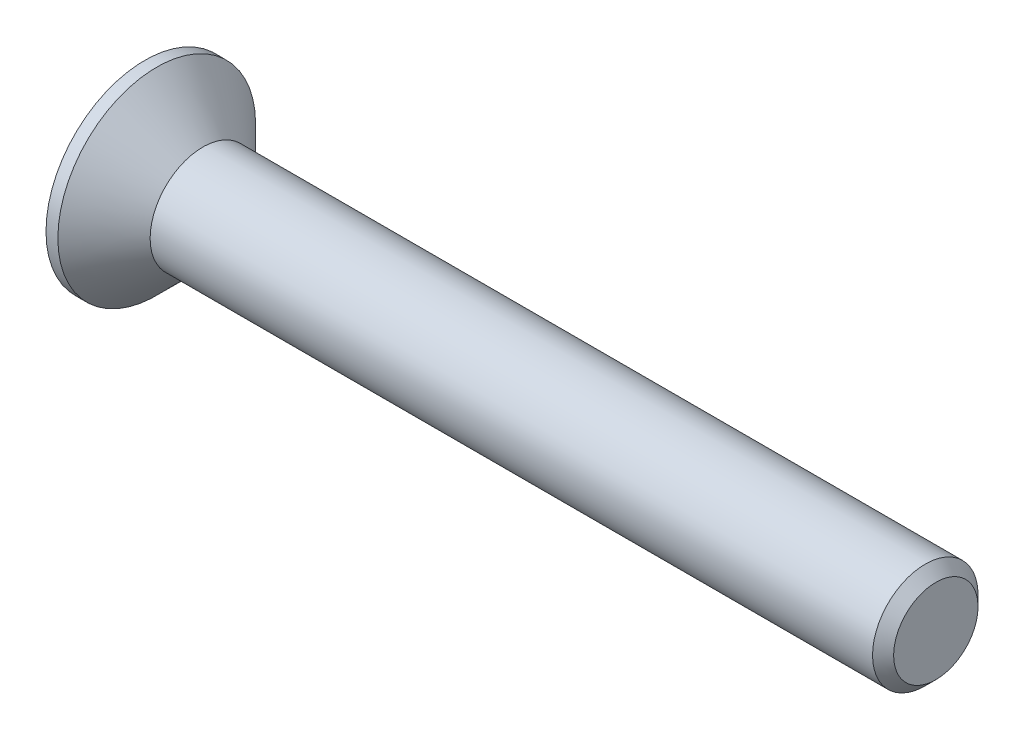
ISO-10303-21;
HEADER;
FILE_DESCRIPTION(('STEP AP214'),'2;1');
FILE_NAME('part.step','',(''),(''),'','','');
FILE_SCHEMA(('AUTOMOTIVE_DESIGN { 1 0 10303 214 1 1 1 1 }'));
ENDSEC;
DATA;
#1=APPLICATION_CONTEXT('core data for automotive mechanical design processes');
#2=APPLICATION_PROTOCOL_DEFINITION('international standard','automotive_design',2000,#1);
#3=PRODUCT_CONTEXT('',#1,'mechanical');
#4=PRODUCT('Part','Part','',(#3));
#5=PRODUCT_RELATED_PRODUCT_CATEGORY('part','',(#4));
#6=PRODUCT_DEFINITION_FORMATION('','',#4);
#7=PRODUCT_DEFINITION_CONTEXT('part definition',#1,'design');
#8=PRODUCT_DEFINITION('design','',#6,#7);
#9=PRODUCT_DEFINITION_SHAPE('','',#8);
#10=(LENGTH_UNIT() NAMED_UNIT(*) SI_UNIT(.MILLI.,.METRE.));
#11=(NAMED_UNIT(*) PLANE_ANGLE_UNIT() SI_UNIT($,.RADIAN.));
#12=(NAMED_UNIT(*) SI_UNIT($,.STERADIAN.) SOLID_ANGLE_UNIT());
#13=UNCERTAINTY_MEASURE_WITH_UNIT(LENGTH_MEASURE(1.E-05),#10,'distance_accuracy_value','');
#14=(GEOMETRIC_REPRESENTATION_CONTEXT(3) GLOBAL_UNCERTAINTY_ASSIGNED_CONTEXT((#13)) GLOBAL_UNIT_ASSIGNED_CONTEXT((#10,
#11,#12)) REPRESENTATION_CONTEXT('',''));
#15=CARTESIAN_POINT('',(0.,0.,0.));
#16=DIRECTION('',(0.,0.,1.));
#17=DIRECTION('',(1.,0.,0.));
#18=AXIS2_PLACEMENT_3D('',#15,#16,#17);
#19=CARTESIAN_POINT('',(0.,0.,0.));
#20=DIRECTION('',(-1.,0.,0.));
#21=DIRECTION('',(0.,0.,1.));
#22=AXIS2_PLACEMENT_3D('',#19,#20,#21);
#23=CONICAL_SURFACE('',#22,2.,0.78539816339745);
#24=CARTESIAN_POINT('',(-1.74999999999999,0.,0.));
#25=DIRECTION('',(-1.,0.,0.));
#26=DIRECTION('',(0.,0.,1.));
#27=AXIS2_PLACEMENT_3D('',#24,#25,#26);
#28=CIRCLE('',#27,3.75);
#29=CARTESIAN_POINT('',(-1.74999999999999,0.,3.75));
#30=VERTEX_POINT('',#29);
#31=EDGE_CURVE('E189',#30,#30,#28,.T.);
#32=ORIENTED_EDGE('',*,*,#31,.F.);
#33=EDGE_LOOP('',(#32));
#34=FACE_BOUND('',#33,.T.);
#35=CARTESIAN_POINT('',(0.,0.,0.));
#36=DIRECTION('',(-1.,0.,0.));
#37=DIRECTION('',(0.,0.,1.));
#38=AXIS2_PLACEMENT_3D('',#35,#36,#37);
#39=CIRCLE('',#38,2.);
#40=CARTESIAN_POINT('',(0.,0.,2.));
#41=VERTEX_POINT('',#40);
#42=EDGE_CURVE('E212',#41,#41,#39,.T.);
#43=ORIENTED_EDGE('',*,*,#42,.T.);
#44=EDGE_LOOP('',(#43));
#45=FACE_BOUND('',#44,.T.);
#46=ADVANCED_FACE('F33',(#34,#45),#23,.T.);
#47=CARTESIAN_POINT('',(-2.2,0.,0.));
#48=DIRECTION('',(-1.,0.,0.));
#49=DIRECTION('',(0.,0.,1.));
#50=AXIS2_PLACEMENT_3D('',#47,#48,#49);
#51=CYLINDRICAL_SURFACE('',#50,2.);
#52=CARTESIAN_POINT('',(27.4,0.,0.));
#53=DIRECTION('',(-1.,0.,0.));
#54=DIRECTION('',(0.,0.,1.));
#55=AXIS2_PLACEMENT_3D('',#52,#53,#54);
#56=CIRCLE('',#55,2.);
#57=CARTESIAN_POINT('',(27.4,0.,2.));
#58=VERTEX_POINT('',#57);
#59=EDGE_CURVE('E41',#58,#58,#56,.T.);
#60=ORIENTED_EDGE('',*,*,#59,.T.);
#61=EDGE_LOOP('',(#60));
#62=FACE_BOUND('',#61,.T.);
#63=ORIENTED_EDGE('',*,*,#42,.F.);
#64=EDGE_LOOP('',(#63));
#65=FACE_BOUND('',#64,.T.);
#66=ADVANCED_FACE('F217',(#62,#65),#51,.T.);
#67=CARTESIAN_POINT('',(27.8,0.,0.));
#68=DIRECTION('',(-1.,0.,0.));
#69=DIRECTION('',(0.,0.,1.));
#70=AXIS2_PLACEMENT_3D('',#67,#68,#69);
#71=PLANE('',#70);
#72=CARTESIAN_POINT('',(27.8,0.,0.));
#73=DIRECTION('',(-1.,0.,0.));
#74=DIRECTION('',(0.,0.,1.));
#75=AXIS2_PLACEMENT_3D('',#72,#73,#74);
#76=CIRCLE('',#75,1.6);
#77=CARTESIAN_POINT('',(27.8,0.,1.6));
#78=VERTEX_POINT('',#77);
#79=EDGE_CURVE('E11',#78,#78,#76,.F.);
#80=ORIENTED_EDGE('',*,*,#79,.T.);
#81=EDGE_LOOP('',(#80));
#82=FACE_BOUND('',#81,.T.);
#83=ADVANCED_FACE('F239',(#82),#71,.F.);
#84=CARTESIAN_POINT('',(-2.2,3.75,0.));
#85=DIRECTION('',(1.,0.,0.));
#86=DIRECTION('',(0.,0.,-1.));
#87=AXIS2_PLACEMENT_3D('',#84,#85,#86);
#88=PLANE('',#87);
#89=DIRECTION('',(0.,0.,-1.));
#90=VECTOR('',#89,1.);
#91=CARTESIAN_POINT('',(-2.2,0.55,-2.2));
#92=LINE('',#91,#90);
#93=CARTESIAN_POINT('',(-2.2,0.55,-0.55));
#94=VERTEX_POINT('',#93);
#95=CARTESIAN_POINT('',(-2.2,0.55,-2.2));
#96=VERTEX_POINT('',#95);
#97=EDGE_CURVE('E158',#94,#96,#92,.T.);
#98=ORIENTED_EDGE('',*,*,#97,.F.);
#99=DIRECTION('',(0.,-1.,0.));
#100=VECTOR('',#99,1.);
#101=CARTESIAN_POINT('',(-2.2,0.55,-0.55));
#102=LINE('',#101,#100);
#103=CARTESIAN_POINT('',(-2.2,2.2,-0.55));
#104=VERTEX_POINT('',#103);
#105=EDGE_CURVE('E48',#104,#94,#102,.T.);
#106=ORIENTED_EDGE('',*,*,#105,.F.);
#107=DIRECTION('',(0.,0.,-1.));
#108=VECTOR('',#107,1.);
#109=CARTESIAN_POINT('',(-2.2,2.2,-0.55));
#110=LINE('',#109,#108);
#111=CARTESIAN_POINT('',(-2.2,2.2,0.55));
#112=VERTEX_POINT('',#111);
#113=EDGE_CURVE('E185',#112,#104,#110,.T.);
#114=ORIENTED_EDGE('',*,*,#113,.F.);
#115=DIRECTION('',(0.,1.,0.));
#116=VECTOR('',#115,1.);
#117=CARTESIAN_POINT('',(-2.2,2.2,0.55));
#118=LINE('',#117,#116);
#119=CARTESIAN_POINT('',(-2.2,0.55,0.55));
#120=VERTEX_POINT('',#119);
#121=EDGE_CURVE('E183',#120,#112,#118,.T.);
#122=ORIENTED_EDGE('',*,*,#121,.F.);
#123=DIRECTION('',(0.,0.,-1.));
#124=VECTOR('',#123,1.);
#125=CARTESIAN_POINT('',(-2.2,0.55,0.55));
#126=LINE('',#125,#124);
#127=CARTESIAN_POINT('',(-2.2,0.55,2.2));
#128=VERTEX_POINT('',#127);
#129=EDGE_CURVE('E132',#128,#120,#126,.T.);
#130=ORIENTED_EDGE('',*,*,#129,.F.);
#131=DIRECTION('',(0.,1.,0.));
#132=VECTOR('',#131,1.);
#133=CARTESIAN_POINT('',(-2.2,0.55,2.2));
#134=LINE('',#133,#132);
#135=CARTESIAN_POINT('',(-2.2,-0.55,2.2));
#136=VERTEX_POINT('',#135);
#137=EDGE_CURVE('E179',#136,#128,#134,.T.);
#138=ORIENTED_EDGE('',*,*,#137,.F.);
#139=DIRECTION('',(0.,0.,1.));
#140=VECTOR('',#139,1.);
#141=CARTESIAN_POINT('',(-2.2,-0.55,2.2));
#142=LINE('',#141,#140);
#143=CARTESIAN_POINT('',(-2.2,-0.55,0.55));
#144=VERTEX_POINT('',#143);
#145=EDGE_CURVE('E176',#144,#136,#142,.T.);
#146=ORIENTED_EDGE('',*,*,#145,.F.);
#147=DIRECTION('',(0.,1.,0.));
#148=VECTOR('',#147,1.);
#149=CARTESIAN_POINT('',(-2.2,-0.55,0.55));
#150=LINE('',#149,#148);
#151=CARTESIAN_POINT('',(-2.2,-2.2,0.55));
#152=VERTEX_POINT('',#151);
#153=EDGE_CURVE('E173',#152,#144,#150,.T.);
#154=ORIENTED_EDGE('',*,*,#153,.F.);
#155=DIRECTION('',(0.,0.,1.));
#156=VECTOR('',#155,1.);
#157=CARTESIAN_POINT('',(-2.2,-2.2,0.55));
#158=LINE('',#157,#156);
#159=CARTESIAN_POINT('',(-2.2,-2.2,-0.55));
#160=VERTEX_POINT('',#159);
#161=EDGE_CURVE('E170',#160,#152,#158,.T.);
#162=ORIENTED_EDGE('',*,*,#161,.F.);
#163=DIRECTION('',(0.,-1.,0.));
#164=VECTOR('',#163,1.);
#165=CARTESIAN_POINT('',(-2.2,-2.2,-0.55));
#166=LINE('',#165,#164);
#167=CARTESIAN_POINT('',(-2.2,-0.55,-0.55));
#168=VERTEX_POINT('',#167);
#169=EDGE_CURVE('E167',#168,#160,#166,.T.);
#170=ORIENTED_EDGE('',*,*,#169,.F.);
#171=DIRECTION('',(0.,0.,1.));
#172=VECTOR('',#171,1.);
#173=CARTESIAN_POINT('',(-2.2,-0.55,-0.55));
#174=LINE('',#173,#172);
#175=CARTESIAN_POINT('',(-2.2,-0.55,-2.2));
#176=VERTEX_POINT('',#175);
#177=EDGE_CURVE('E164',#176,#168,#174,.T.);
#178=ORIENTED_EDGE('',*,*,#177,.F.);
#179=DIRECTION('',(0.,-1.,0.));
#180=VECTOR('',#179,1.);
#181=CARTESIAN_POINT('',(-2.2,-0.55,-2.2));
#182=LINE('',#181,#180);
#183=EDGE_CURVE('E161',#96,#176,#182,.T.);
#184=ORIENTED_EDGE('',*,*,#183,.F.);
#185=EDGE_LOOP('',(#98,#106,#114,#122,#130,#138,#146,#154,#162,#170,#178,#184));
#186=FACE_BOUND('',#185,.T.);
#187=CARTESIAN_POINT('',(-2.2,0.,0.));
#188=DIRECTION('',(-1.,0.,0.));
#189=DIRECTION('',(0.,0.,1.));
#190=AXIS2_PLACEMENT_3D('',#187,#188,#189);
#191=CIRCLE('',#190,3.75);
#192=CARTESIAN_POINT('',(-2.2,0.,3.75));
#193=VERTEX_POINT('',#192);
#194=EDGE_CURVE('E209',#193,#193,#191,.T.);
#195=ORIENTED_EDGE('',*,*,#194,.T.);
#196=EDGE_LOOP('',(#195));
#197=FACE_BOUND('',#196,.T.);
#198=ADVANCED_FACE('F230',(#186,#197),#88,.F.);
#199=CARTESIAN_POINT('',(-2.2,0.,0.));
#200=DIRECTION('',(-1.,0.,0.));
#201=DIRECTION('',(0.,0.,1.));
#202=AXIS2_PLACEMENT_3D('',#199,#200,#201);
#203=CYLINDRICAL_SURFACE('',#202,3.75);
#204=ORIENTED_EDGE('',*,*,#194,.F.);
#205=EDGE_LOOP('',(#204));
#206=FACE_BOUND('',#205,.T.);
#207=ORIENTED_EDGE('',*,*,#31,.T.);
#208=EDGE_LOOP('',(#207));
#209=FACE_BOUND('',#208,.T.);
#210=ADVANCED_FACE('F222',(#206,#209),#203,.T.);
#211=CARTESIAN_POINT('',(27.4,0.,0.));
#212=DIRECTION('',(-1.,0.,0.));
#213=DIRECTION('',(0.,0.,1.));
#214=AXIS2_PLACEMENT_3D('',#211,#212,#213);
#215=CONICAL_SURFACE('',#214,2.,0.78539816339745);
#216=ORIENTED_EDGE('',*,*,#79,.F.);
#217=EDGE_LOOP('',(#216));
#218=FACE_BOUND('',#217,.T.);
#219=ORIENTED_EDGE('',*,*,#59,.F.);
#220=EDGE_LOOP('',(#219));
#221=FACE_BOUND('',#220,.T.);
#222=ADVANCED_FACE('F35',(#218,#221),#215,.T.);
#223=CARTESIAN_POINT('',(-0.3,0.55,-0.55));
#224=DIRECTION('',(0.,0.,-1.));
#225=DIRECTION('',(-1.,0.,0.));
#226=AXIS2_PLACEMENT_3D('',#223,#224,#225);
#227=PLANE('',#226);
#228=ORIENTED_EDGE('',*,*,#105,.T.);
#229=DIRECTION('',(-1.,0.,0.));
#230=VECTOR('',#229,1.);
#231=CARTESIAN_POINT('',(-0.3,0.55,-0.55));
#232=LINE('',#231,#230);
#233=CARTESIAN_POINT('',(-0.3,0.55,-0.55));
#234=VERTEX_POINT('',#233);
#235=EDGE_CURVE('E96',#234,#94,#232,.T.);
#236=ORIENTED_EDGE('',*,*,#235,.F.);
#237=DIRECTION('',(0.,-1.,0.));
#238=VECTOR('',#237,1.);
#239=CARTESIAN_POINT('',(-0.3,0.55,-0.55));
#240=LINE('',#239,#238);
#241=CARTESIAN_POINT('',(-0.3,2.2,-0.55));
#242=VERTEX_POINT('',#241);
#243=EDGE_CURVE('E187',#242,#234,#240,.T.);
#244=ORIENTED_EDGE('',*,*,#243,.F.);
#245=DIRECTION('',(-1.,0.,0.));
#246=VECTOR('',#245,1.);
#247=CARTESIAN_POINT('',(-0.3,2.2,-0.55));
#248=LINE('',#247,#246);
#249=EDGE_CURVE('E56',#242,#104,#248,.T.);
#250=ORIENTED_EDGE('',*,*,#249,.T.);
#251=EDGE_LOOP('',(#228,#236,#244,#250));
#252=FACE_BOUND('',#251,.T.);
#253=ADVANCED_FACE('F221',(#252),#227,.F.);
#254=CARTESIAN_POINT('',(-0.3,2.2,-0.55));
#255=DIRECTION('',(0.,1.,0.));
#256=DIRECTION('',(-1.,0.,0.));
#257=AXIS2_PLACEMENT_3D('',#254,#255,#256);
#258=PLANE('',#257);
#259=ORIENTED_EDGE('',*,*,#113,.T.);
#260=ORIENTED_EDGE('',*,*,#249,.F.);
#261=DIRECTION('',(0.,0.,-1.));
#262=VECTOR('',#261,1.);
#263=CARTESIAN_POINT('',(-0.3,2.2,-0.55));
#264=LINE('',#263,#262);
#265=CARTESIAN_POINT('',(-0.3,2.2,0.55));
#266=VERTEX_POINT('',#265);
#267=EDGE_CURVE('E144',#266,#242,#264,.T.);
#268=ORIENTED_EDGE('',*,*,#267,.F.);
#269=DIRECTION('',(-1.,0.,0.));
#270=VECTOR('',#269,1.);
#271=CARTESIAN_POINT('',(-0.3,2.2,0.55));
#272=LINE('',#271,#270);
#273=EDGE_CURVE('E136',#266,#112,#272,.T.);
#274=ORIENTED_EDGE('',*,*,#273,.T.);
#275=EDGE_LOOP('',(#259,#260,#268,#274));
#276=FACE_BOUND('',#275,.T.);
#277=ADVANCED_FACE('F228',(#276),#258,.F.);
#278=CARTESIAN_POINT('',(-0.3,2.2,0.55));
#279=DIRECTION('',(0.,0.,1.));
#280=DIRECTION('',(1.,0.,0.));
#281=AXIS2_PLACEMENT_3D('',#278,#279,#280);
#282=PLANE('',#281);
#283=ORIENTED_EDGE('',*,*,#121,.T.);
#284=ORIENTED_EDGE('',*,*,#273,.F.);
#285=DIRECTION('',(0.,1.,0.));
#286=VECTOR('',#285,1.);
#287=CARTESIAN_POINT('',(-0.3,2.2,0.55));
#288=LINE('',#287,#286);
#289=CARTESIAN_POINT('',(-0.3,0.55,0.55));
#290=VERTEX_POINT('',#289);
#291=EDGE_CURVE('E140',#290,#266,#288,.T.);
#292=ORIENTED_EDGE('',*,*,#291,.F.);
#293=DIRECTION('',(-1.,0.,0.));
#294=VECTOR('',#293,1.);
#295=CARTESIAN_POINT('',(-0.3,0.55,0.55));
#296=LINE('',#295,#294);
#297=EDGE_CURVE('E125',#290,#120,#296,.T.);
#298=ORIENTED_EDGE('',*,*,#297,.T.);
#299=EDGE_LOOP('',(#283,#284,#292,#298));
#300=FACE_BOUND('',#299,.T.);
#301=ADVANCED_FACE('F141',(#300),#282,.F.);
#302=CARTESIAN_POINT('',(-0.3,0.55,0.55));
#303=DIRECTION('',(0.,1.,0.));
#304=DIRECTION('',(-1.,0.,0.));
#305=AXIS2_PLACEMENT_3D('',#302,#303,#304);
#306=PLANE('',#305);
#307=ORIENTED_EDGE('',*,*,#129,.T.);
#308=ORIENTED_EDGE('',*,*,#297,.F.);
#309=DIRECTION('',(0.,0.,-1.));
#310=VECTOR('',#309,1.);
#311=CARTESIAN_POINT('',(-0.3,0.55,0.55));
#312=LINE('',#311,#310);
#313=CARTESIAN_POINT('',(-0.3,0.55,2.2));
#314=VERTEX_POINT('',#313);
#315=EDGE_CURVE('E129',#314,#290,#312,.T.);
#316=ORIENTED_EDGE('',*,*,#315,.F.);
#317=DIRECTION('',(-1.,0.,0.));
#318=VECTOR('',#317,1.);
#319=CARTESIAN_POINT('',(-0.3,0.55,2.2));
#320=LINE('',#319,#318);
#321=EDGE_CURVE('E137',#314,#128,#320,.T.);
#322=ORIENTED_EDGE('',*,*,#321,.T.);
#323=EDGE_LOOP('',(#307,#308,#316,#322));
#324=FACE_BOUND('',#323,.T.);
#325=ADVANCED_FACE('F127',(#324),#306,.F.);
#326=CARTESIAN_POINT('',(-0.3,0.55,2.2));
#327=DIRECTION('',(0.,0.,1.));
#328=DIRECTION('',(1.,0.,0.));
#329=AXIS2_PLACEMENT_3D('',#326,#327,#328);
#330=PLANE('',#329);
#331=ORIENTED_EDGE('',*,*,#137,.T.);
#332=ORIENTED_EDGE('',*,*,#321,.F.);
#333=DIRECTION('',(0.,1.,0.));
#334=VECTOR('',#333,1.);
#335=CARTESIAN_POINT('',(-0.3,0.55,2.2));
#336=LINE('',#335,#334);
#337=CARTESIAN_POINT('',(-0.3,-0.55,2.2));
#338=VERTEX_POINT('',#337);
#339=EDGE_CURVE('E150',#338,#314,#336,.T.);
#340=ORIENTED_EDGE('',*,*,#339,.F.);
#341=DIRECTION('',(-1.,0.,0.));
#342=VECTOR('',#341,1.);
#343=CARTESIAN_POINT('',(-0.3,-0.55,2.2));
#344=LINE('',#343,#342);
#345=EDGE_CURVE('E192',#338,#136,#344,.T.);
#346=ORIENTED_EDGE('',*,*,#345,.T.);
#347=EDGE_LOOP('',(#331,#332,#340,#346));
#348=FACE_BOUND('',#347,.T.);
#349=ADVANCED_FACE('F277',(#348),#330,.F.);
#350=CARTESIAN_POINT('',(-0.3,-0.55,2.2));
#351=DIRECTION('',(0.,-1.,0.));
#352=DIRECTION('',(1.,0.,0.));
#353=AXIS2_PLACEMENT_3D('',#350,#351,#352);
#354=PLANE('',#353);
#355=ORIENTED_EDGE('',*,*,#145,.T.);
#356=ORIENTED_EDGE('',*,*,#345,.F.);
#357=DIRECTION('',(0.,0.,1.));
#358=VECTOR('',#357,1.);
#359=CARTESIAN_POINT('',(-0.3,-0.55,2.2));
#360=LINE('',#359,#358);
#361=CARTESIAN_POINT('',(-0.3,-0.55,0.55));
#362=VERTEX_POINT('',#361);
#363=EDGE_CURVE('E152',#362,#338,#360,.T.);
#364=ORIENTED_EDGE('',*,*,#363,.F.);
#365=DIRECTION('',(-1.,0.,0.));
#366=VECTOR('',#365,1.);
#367=CARTESIAN_POINT('',(-0.3,-0.55,0.55));
#368=LINE('',#367,#366);
#369=EDGE_CURVE('E194',#362,#144,#368,.T.);
#370=ORIENTED_EDGE('',*,*,#369,.T.);
#371=EDGE_LOOP('',(#355,#356,#364,#370));
#372=FACE_BOUND('',#371,.T.);
#373=ADVANCED_FACE('F273',(#372),#354,.F.);
#374=CARTESIAN_POINT('',(-0.3,-0.55,0.55));
#375=DIRECTION('',(0.,0.,1.));
#376=DIRECTION('',(1.,0.,0.));
#377=AXIS2_PLACEMENT_3D('',#374,#375,#376);
#378=PLANE('',#377);
#379=ORIENTED_EDGE('',*,*,#153,.T.);
#380=ORIENTED_EDGE('',*,*,#369,.F.);
#381=DIRECTION('',(0.,1.,0.));
#382=VECTOR('',#381,1.);
#383=CARTESIAN_POINT('',(-0.3,-0.55,0.55));
#384=LINE('',#383,#382);
#385=CARTESIAN_POINT('',(-0.3,-2.2,0.55));
#386=VERTEX_POINT('',#385);
#387=EDGE_CURVE('E422',#386,#362,#384,.T.);
#388=ORIENTED_EDGE('',*,*,#387,.F.);
#389=DIRECTION('',(-1.,0.,0.));
#390=VECTOR('',#389,1.);
#391=CARTESIAN_POINT('',(-0.3,-2.2,0.55));
#392=LINE('',#391,#390);
#393=EDGE_CURVE('E196',#386,#152,#392,.T.);
#394=ORIENTED_EDGE('',*,*,#393,.T.);
#395=EDGE_LOOP('',(#379,#380,#388,#394));
#396=FACE_BOUND('',#395,.T.);
#397=ADVANCED_FACE('F269',(#396),#378,.F.);
#398=CARTESIAN_POINT('',(-0.3,-2.2,0.55));
#399=DIRECTION('',(0.,-1.,0.));
#400=DIRECTION('',(1.,0.,0.));
#401=AXIS2_PLACEMENT_3D('',#398,#399,#400);
#402=PLANE('',#401);
#403=ORIENTED_EDGE('',*,*,#161,.T.);
#404=ORIENTED_EDGE('',*,*,#393,.F.);
#405=DIRECTION('',(0.,0.,1.));
#406=VECTOR('',#405,1.);
#407=CARTESIAN_POINT('',(-0.3,-2.2,0.55));
#408=LINE('',#407,#406);
#409=CARTESIAN_POINT('',(-0.3,-2.2,-0.55));
#410=VERTEX_POINT('',#409);
#411=EDGE_CURVE('E419',#410,#386,#408,.T.);
#412=ORIENTED_EDGE('',*,*,#411,.F.);
#413=DIRECTION('',(-1.,0.,0.));
#414=VECTOR('',#413,1.);
#415=CARTESIAN_POINT('',(-0.3,-2.2,-0.55));
#416=LINE('',#415,#414);
#417=EDGE_CURVE('E198',#410,#160,#416,.T.);
#418=ORIENTED_EDGE('',*,*,#417,.T.);
#419=EDGE_LOOP('',(#403,#404,#412,#418));
#420=FACE_BOUND('',#419,.T.);
#421=ADVANCED_FACE('F265',(#420),#402,.F.);
#422=CARTESIAN_POINT('',(-0.3,-2.2,-0.55));
#423=DIRECTION('',(0.,0.,-1.));
#424=DIRECTION('',(-1.,0.,0.));
#425=AXIS2_PLACEMENT_3D('',#422,#423,#424);
#426=PLANE('',#425);
#427=ORIENTED_EDGE('',*,*,#169,.T.);
#428=ORIENTED_EDGE('',*,*,#417,.F.);
#429=DIRECTION('',(0.,-1.,0.));
#430=VECTOR('',#429,1.);
#431=CARTESIAN_POINT('',(-0.3,-2.2,-0.55));
#432=LINE('',#431,#430);
#433=CARTESIAN_POINT('',(-0.3,-0.55,-0.55));
#434=VERTEX_POINT('',#433);
#435=EDGE_CURVE('E416',#434,#410,#432,.T.);
#436=ORIENTED_EDGE('',*,*,#435,.F.);
#437=DIRECTION('',(-1.,0.,0.));
#438=VECTOR('',#437,1.);
#439=CARTESIAN_POINT('',(-0.3,-0.55,-0.55));
#440=LINE('',#439,#438);
#441=EDGE_CURVE('E200',#434,#168,#440,.T.);
#442=ORIENTED_EDGE('',*,*,#441,.T.);
#443=EDGE_LOOP('',(#427,#428,#436,#442));
#444=FACE_BOUND('',#443,.T.);
#445=ADVANCED_FACE('F261',(#444),#426,.F.);
#446=CARTESIAN_POINT('',(-0.3,-0.55,-0.55));
#447=DIRECTION('',(0.,-1.,0.));
#448=DIRECTION('',(1.,0.,0.));
#449=AXIS2_PLACEMENT_3D('',#446,#447,#448);
#450=PLANE('',#449);
#451=ORIENTED_EDGE('',*,*,#177,.T.);
#452=ORIENTED_EDGE('',*,*,#441,.F.);
#453=DIRECTION('',(0.,0.,1.));
#454=VECTOR('',#453,1.);
#455=CARTESIAN_POINT('',(-0.3,-0.55,-0.55));
#456=LINE('',#455,#454);
#457=CARTESIAN_POINT('',(-0.3,-0.55,-2.2));
#458=VERTEX_POINT('',#457);
#459=EDGE_CURVE('E413',#458,#434,#456,.T.);
#460=ORIENTED_EDGE('',*,*,#459,.F.);
#461=DIRECTION('',(-1.,0.,0.));
#462=VECTOR('',#461,1.);
#463=CARTESIAN_POINT('',(-0.3,-0.55,-2.2));
#464=LINE('',#463,#462);
#465=EDGE_CURVE('E202',#458,#176,#464,.T.);
#466=ORIENTED_EDGE('',*,*,#465,.T.);
#467=EDGE_LOOP('',(#451,#452,#460,#466));
#468=FACE_BOUND('',#467,.T.);
#469=ADVANCED_FACE('F257',(#468),#450,.F.);
#470=CARTESIAN_POINT('',(-0.3,-0.55,-2.2));
#471=DIRECTION('',(0.,0.,-1.));
#472=DIRECTION('',(-1.,0.,0.));
#473=AXIS2_PLACEMENT_3D('',#470,#471,#472);
#474=PLANE('',#473);
#475=ORIENTED_EDGE('',*,*,#183,.T.);
#476=ORIENTED_EDGE('',*,*,#465,.F.);
#477=DIRECTION('',(0.,-1.,0.));
#478=VECTOR('',#477,1.);
#479=CARTESIAN_POINT('',(-0.3,-0.55,-2.2));
#480=LINE('',#479,#478);
#481=CARTESIAN_POINT('',(-0.3,0.55,-2.2));
#482=VERTEX_POINT('',#481);
#483=EDGE_CURVE('E408',#482,#458,#480,.T.);
#484=ORIENTED_EDGE('',*,*,#483,.F.);
#485=DIRECTION('',(-1.,0.,0.));
#486=VECTOR('',#485,1.);
#487=CARTESIAN_POINT('',(-0.3,0.55,-2.2));
#488=LINE('',#487,#486);
#489=EDGE_CURVE('E204',#482,#96,#488,.T.);
#490=ORIENTED_EDGE('',*,*,#489,.T.);
#491=EDGE_LOOP('',(#475,#476,#484,#490));
#492=FACE_BOUND('',#491,.T.);
#493=ADVANCED_FACE('F253',(#492),#474,.F.);
#494=CARTESIAN_POINT('',(-0.3,0.55,-2.2));
#495=DIRECTION('',(0.,1.,0.));
#496=DIRECTION('',(-1.,0.,0.));
#497=AXIS2_PLACEMENT_3D('',#494,#495,#496);
#498=PLANE('',#497);
#499=ORIENTED_EDGE('',*,*,#97,.T.);
#500=ORIENTED_EDGE('',*,*,#489,.F.);
#501=DIRECTION('',(0.,0.,-1.));
#502=VECTOR('',#501,1.);
#503=CARTESIAN_POINT('',(-0.3,0.55,-2.2));
#504=LINE('',#503,#502);
#505=EDGE_CURVE('E406',#234,#482,#504,.T.);
#506=ORIENTED_EDGE('',*,*,#505,.F.);
#507=ORIENTED_EDGE('',*,*,#235,.T.);
#508=EDGE_LOOP('',(#499,#500,#506,#507));
#509=FACE_BOUND('',#508,.T.);
#510=ADVANCED_FACE('F250',(#509),#498,.F.);
#511=CARTESIAN_POINT('',(-0.3,0.,0.));
#512=DIRECTION('',(1.,0.,0.));
#513=DIRECTION('',(0.,0.,-1.));
#514=AXIS2_PLACEMENT_3D('',#511,#512,#513);
#515=PLANE('',#514);
#516=ORIENTED_EDGE('',*,*,#243,.T.);
#517=ORIENTED_EDGE('',*,*,#505,.T.);
#518=ORIENTED_EDGE('',*,*,#483,.T.);
#519=ORIENTED_EDGE('',*,*,#459,.T.);
#520=ORIENTED_EDGE('',*,*,#435,.T.);
#521=ORIENTED_EDGE('',*,*,#411,.T.);
#522=ORIENTED_EDGE('',*,*,#387,.T.);
#523=ORIENTED_EDGE('',*,*,#363,.T.);
#524=ORIENTED_EDGE('',*,*,#339,.T.);
#525=ORIENTED_EDGE('',*,*,#315,.T.);
#526=ORIENTED_EDGE('',*,*,#291,.T.);
#527=ORIENTED_EDGE('',*,*,#267,.T.);
#528=EDGE_LOOP('',(#516,#517,#518,#519,#520,#521,#522,#523,#524,#525,#526,#527));
#529=FACE_BOUND('',#528,.T.);
#530=ADVANCED_FACE('F147',(#529),#515,.F.);
#531=CLOSED_SHELL('',(#46,#66,#83,#198,#210,#222,#253,#277,#301,#325,#349,#373,#397,#421,#445,
#469,#493,#510,#530));
#532=MANIFOLD_SOLID_BREP('B2',#531);
#533=ADVANCED_BREP_SHAPE_REPRESENTATION('',(#18,#532),#14);
#534=SHAPE_DEFINITION_REPRESENTATION(#9,#533);
ENDSEC;
END-ISO-10303-21;
